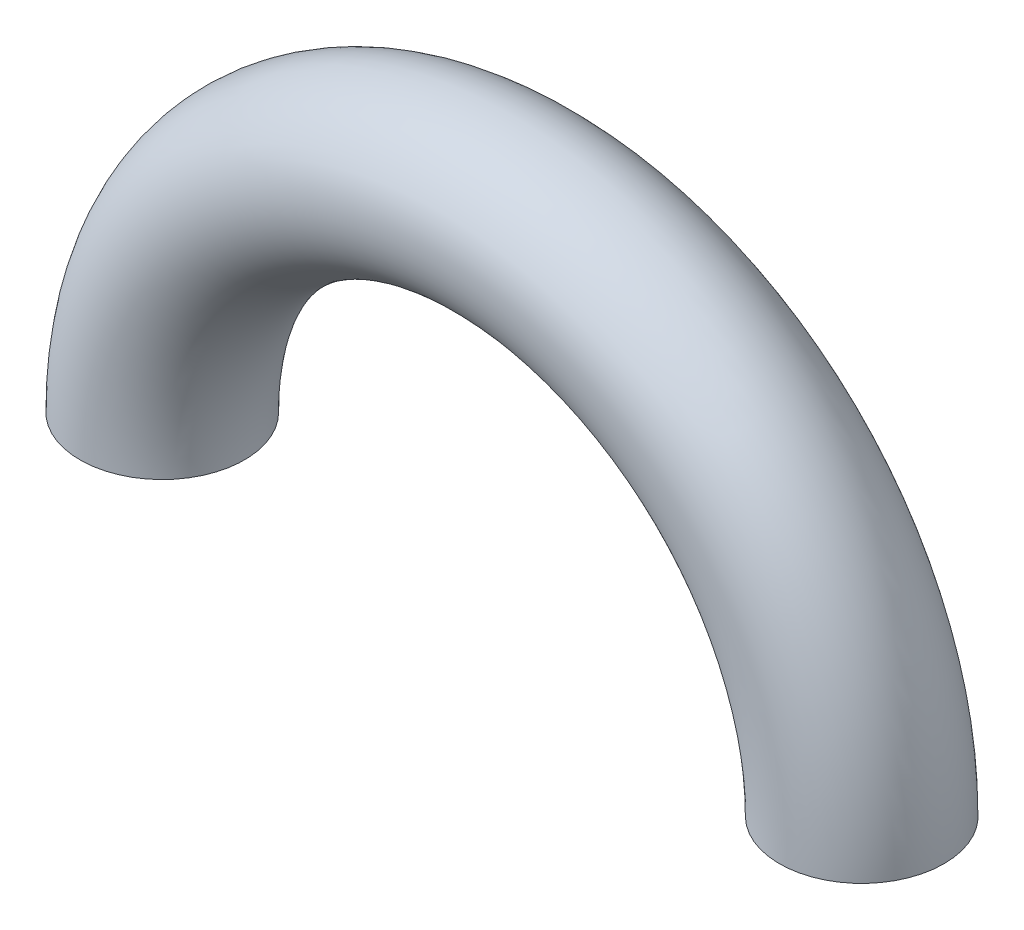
from build123d import *

# Parameters (mm, degrees)
SKIZZE2_R = 4


with BuildPart() as part:
    # Basis-Austragung: sweep along a path in Skizze1
    with BuildLine(Plane.XY) as basis_austragung_path:
        ThreePointArc((17, 0), (0, 17), (-17, 0))
    # Skizze2 → Basis-Austragung (sweep)
    with BuildSketch(Plane(origin=(0, 0, 0), x_dir=(1, 0, 0), z_dir=(0, 1, 0))):
        with Locations((17, 0)):
            Circle(SKIZZE2_R)
    sweep(path=basis_austragung_path.line)


solid = part.part
